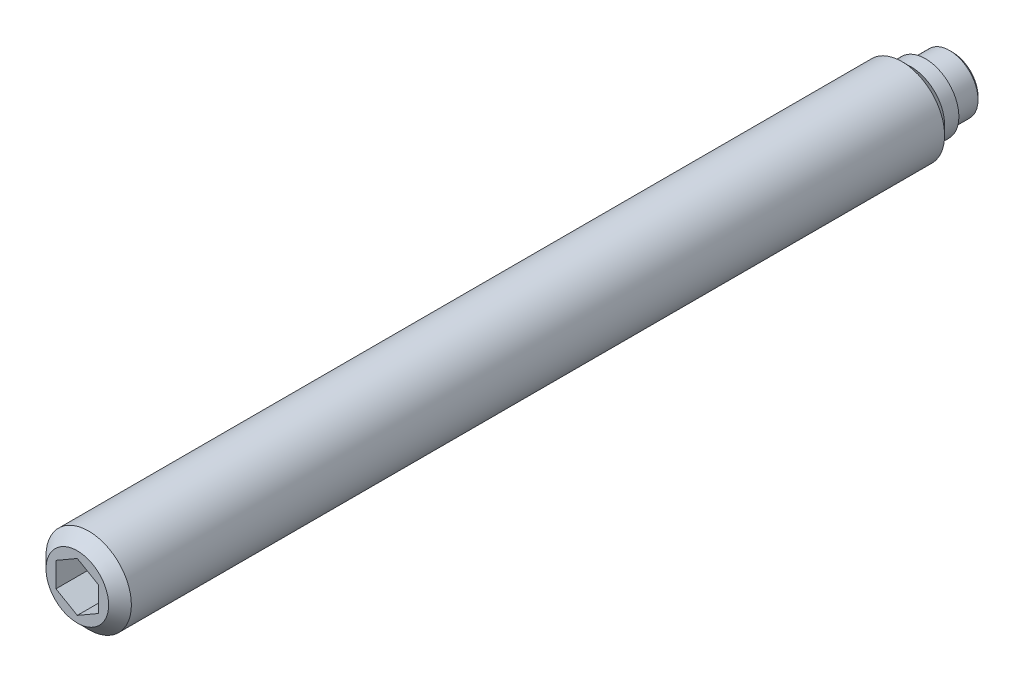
ISO-10303-21;
HEADER;
FILE_DESCRIPTION(('STEP AP214'),'2;1');
FILE_NAME('part.step','',(''),(''),'','','');
FILE_SCHEMA(('AUTOMOTIVE_DESIGN { 1 0 10303 214 1 1 1 1 }'));
ENDSEC;
DATA;
#1=APPLICATION_CONTEXT('core data for automotive mechanical design processes');
#2=APPLICATION_PROTOCOL_DEFINITION('international standard','automotive_design',2000,#1);
#3=PRODUCT_CONTEXT('',#1,'mechanical');
#4=PRODUCT('Part','Part','',(#3));
#5=PRODUCT_RELATED_PRODUCT_CATEGORY('part','',(#4));
#6=PRODUCT_DEFINITION_FORMATION('','',#4);
#7=PRODUCT_DEFINITION_CONTEXT('part definition',#1,'design');
#8=PRODUCT_DEFINITION('design','',#6,#7);
#9=PRODUCT_DEFINITION_SHAPE('','',#8);
#10=(LENGTH_UNIT() NAMED_UNIT(*) SI_UNIT(.MILLI.,.METRE.));
#11=(NAMED_UNIT(*) PLANE_ANGLE_UNIT() SI_UNIT($,.RADIAN.));
#12=(NAMED_UNIT(*) SI_UNIT($,.STERADIAN.) SOLID_ANGLE_UNIT());
#13=UNCERTAINTY_MEASURE_WITH_UNIT(LENGTH_MEASURE(1.E-05),#10,'distance_accuracy_value','');
#14=(GEOMETRIC_REPRESENTATION_CONTEXT(3) GLOBAL_UNCERTAINTY_ASSIGNED_CONTEXT((#13)) GLOBAL_UNIT_ASSIGNED_CONTEXT((#10,
#11,#12)) REPRESENTATION_CONTEXT('',''));
#15=CARTESIAN_POINT('',(0.,0.,0.));
#16=DIRECTION('',(0.,0.,1.));
#17=DIRECTION('',(1.,0.,0.));
#18=AXIS2_PLACEMENT_3D('',#15,#16,#17);
#19=CARTESIAN_POINT('',(0.,0.,1.9));
#20=DIRECTION('',(0.,0.,-1.));
#21=DIRECTION('',(-1.,0.,0.));
#22=AXIS2_PLACEMENT_3D('',#19,#20,#21);
#23=CYLINDRICAL_SURFACE('',#22,3.);
#24=CARTESIAN_POINT('',(0.,0.,3.55));
#25=DIRECTION('',(0.,0.,-1.));
#26=DIRECTION('',(-1.,0.,0.));
#27=AXIS2_PLACEMENT_3D('',#24,#25,#26);
#28=CIRCLE('',#27,3.);
#29=CARTESIAN_POINT('',(-3.,0.,3.55));
#30=VERTEX_POINT('',#29);
#31=EDGE_CURVE('E9',#30,#30,#28,.T.);
#32=ORIENTED_EDGE('',*,*,#31,.F.);
#33=EDGE_LOOP('',(#32));
#34=FACE_BOUND('',#33,.T.);
#35=CARTESIAN_POINT('',(0.,0.,60.7));
#36=DIRECTION('',(0.,0.,1.));
#37=DIRECTION('',(1.,0.,0.));
#38=AXIS2_PLACEMENT_3D('',#35,#36,#37);
#39=CIRCLE('',#38,3.);
#40=CARTESIAN_POINT('',(3.,0.,60.7));
#41=VERTEX_POINT('',#40);
#42=EDGE_CURVE('E123',#41,#41,#39,.T.);
#43=ORIENTED_EDGE('',*,*,#42,.F.);
#44=EDGE_LOOP('',(#43));
#45=FACE_BOUND('',#44,.T.);
#46=ADVANCED_FACE('F14',(#34,#45),#23,.T.);
#47=CARTESIAN_POINT('',(0.,0.,3.55));
#48=DIRECTION('',(0.,0.,1.));
#49=DIRECTION('',(1.,0.,0.));
#50=AXIS2_PLACEMENT_3D('',#47,#48,#49);
#51=CONICAL_SURFACE('',#50,3.,0.785398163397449);
#52=ORIENTED_EDGE('',*,*,#31,.T.);
#53=EDGE_LOOP('',(#52));
#54=FACE_BOUND('',#53,.T.);
#55=CARTESIAN_POINT('',(0.,0.,2.9));
#56=DIRECTION('',(0.,0.,-1.));
#57=DIRECTION('',(-1.,0.,0.));
#58=AXIS2_PLACEMENT_3D('',#55,#56,#57);
#59=CIRCLE('',#58,2.35);
#60=CARTESIAN_POINT('',(-2.35,0.,2.9));
#61=VERTEX_POINT('',#60);
#62=EDGE_CURVE('E21',#61,#61,#59,.T.);
#63=ORIENTED_EDGE('',*,*,#62,.F.);
#64=EDGE_LOOP('',(#63));
#65=FACE_BOUND('',#64,.T.);
#66=ADVANCED_FACE('F143',(#54,#65),#51,.T.);
#67=CARTESIAN_POINT('',(0.,0.,1.9));
#68=DIRECTION('',(0.,0.,-1.));
#69=DIRECTION('',(-1.,0.,0.));
#70=AXIS2_PLACEMENT_3D('',#67,#68,#69);
#71=CYLINDRICAL_SURFACE('',#70,2.35);
#72=ORIENTED_EDGE('',*,*,#62,.T.);
#73=EDGE_LOOP('',(#72));
#74=FACE_BOUND('',#73,.T.);
#75=CARTESIAN_POINT('',(0.,0.,1.9));
#76=DIRECTION('',(0.,0.,-1.));
#77=DIRECTION('',(-1.,0.,0.));
#78=AXIS2_PLACEMENT_3D('',#75,#76,#77);
#79=CIRCLE('',#78,2.35);
#80=CARTESIAN_POINT('',(-2.35,0.,1.9));
#81=VERTEX_POINT('',#80);
#82=EDGE_CURVE('E135',#81,#81,#79,.T.);
#83=ORIENTED_EDGE('',*,*,#82,.F.);
#84=EDGE_LOOP('',(#83));
#85=FACE_BOUND('',#84,.T.);
#86=ADVANCED_FACE('F140',(#74,#85),#71,.T.);
#87=CARTESIAN_POINT('',(0.,2.35,1.9));
#88=DIRECTION('',(0.,0.,1.));
#89=DIRECTION('',(1.,0.,0.));
#90=AXIS2_PLACEMENT_3D('',#87,#88,#89);
#91=PLANE('',#90);
#92=ORIENTED_EDGE('',*,*,#82,.T.);
#93=EDGE_LOOP('',(#92));
#94=FACE_BOUND('',#93,.T.);
#95=CARTESIAN_POINT('',(0.,0.,1.9));
#96=DIRECTION('',(0.,0.,-1.));
#97=DIRECTION('',(-1.,0.,0.));
#98=AXIS2_PLACEMENT_3D('',#95,#96,#97);
#99=CIRCLE('',#98,2.);
#100=CARTESIAN_POINT('',(-2.,0.,1.9));
#101=VERTEX_POINT('',#100);
#102=EDGE_CURVE('E132',#101,#101,#99,.T.);
#103=ORIENTED_EDGE('',*,*,#102,.F.);
#104=EDGE_LOOP('',(#103));
#105=FACE_BOUND('',#104,.T.);
#106=ADVANCED_FACE('F151',(#94,#105),#91,.F.);
#107=CARTESIAN_POINT('',(0.,0.,0.));
#108=DIRECTION('',(0.,0.,-1.));
#109=DIRECTION('',(-1.,0.,0.));
#110=AXIS2_PLACEMENT_3D('',#107,#108,#109);
#111=CYLINDRICAL_SURFACE('',#110,2.);
#112=CARTESIAN_POINT('',(0.,0.,0.2));
#113=DIRECTION('',(0.,0.,-1.));
#114=DIRECTION('',(-1.,0.,0.));
#115=AXIS2_PLACEMENT_3D('',#112,#113,#114);
#116=CIRCLE('',#115,2.);
#117=CARTESIAN_POINT('',(-2.,0.,0.2));
#118=VERTEX_POINT('',#117);
#119=EDGE_CURVE('E129',#118,#118,#116,.T.);
#120=ORIENTED_EDGE('',*,*,#119,.F.);
#121=EDGE_LOOP('',(#120));
#122=FACE_BOUND('',#121,.T.);
#123=ORIENTED_EDGE('',*,*,#102,.T.);
#124=EDGE_LOOP('',(#123));
#125=FACE_BOUND('',#124,.T.);
#126=ADVANCED_FACE('F157',(#122,#125),#111,.T.);
#127=CARTESIAN_POINT('',(0.,0.,0.2));
#128=DIRECTION('',(0.,0.,1.));
#129=DIRECTION('',(1.,0.,0.));
#130=AXIS2_PLACEMENT_3D('',#127,#128,#129);
#131=CONICAL_SURFACE('',#130,2.,0.785398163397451);
#132=CARTESIAN_POINT('',(0.,0.,0.));
#133=DIRECTION('',(0.,0.,-1.));
#134=DIRECTION('',(-1.,0.,0.));
#135=AXIS2_PLACEMENT_3D('',#132,#133,#134);
#136=CIRCLE('',#135,1.8);
#137=CARTESIAN_POINT('',(-1.8,0.,0.));
#138=VERTEX_POINT('',#137);
#139=EDGE_CURVE('E126',#138,#138,#136,.T.);
#140=ORIENTED_EDGE('',*,*,#139,.F.);
#141=EDGE_LOOP('',(#140));
#142=FACE_BOUND('',#141,.T.);
#143=ORIENTED_EDGE('',*,*,#119,.T.);
#144=EDGE_LOOP('',(#143));
#145=FACE_BOUND('',#144,.T.);
#146=ADVANCED_FACE('F161',(#142,#145),#131,.T.);
#147=CARTESIAN_POINT('',(0.,1.8,0.));
#148=DIRECTION('',(0.,0.,1.));
#149=DIRECTION('',(1.,0.,0.));
#150=AXIS2_PLACEMENT_3D('',#147,#148,#149);
#151=PLANE('',#150);
#152=ORIENTED_EDGE('',*,*,#139,.T.);
#153=EDGE_LOOP('',(#152));
#154=FACE_BOUND('',#153,.T.);
#155=ADVANCED_FACE('F165',(#154),#151,.F.);
#156=CARTESIAN_POINT('',(0.,0.,61.5));
#157=DIRECTION('',(0.,0.,-1.));
#158=DIRECTION('',(-1.,0.,0.));
#159=AXIS2_PLACEMENT_3D('',#156,#157,#158);
#160=CONICAL_SURFACE('',#159,2.2,0.785398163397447);
#161=ORIENTED_EDGE('',*,*,#42,.T.);
#162=EDGE_LOOP('',(#161));
#163=FACE_BOUND('',#162,.T.);
#164=CARTESIAN_POINT('',(0.,0.,61.5));
#165=DIRECTION('',(0.,0.,1.));
#166=DIRECTION('',(1.,0.,0.));
#167=AXIS2_PLACEMENT_3D('',#164,#165,#166);
#168=CIRCLE('',#167,2.2);
#169=CARTESIAN_POINT('',(2.2,0.,61.5));
#170=VERTEX_POINT('',#169);
#171=EDGE_CURVE('E115',#170,#170,#168,.T.);
#172=ORIENTED_EDGE('',*,*,#171,.F.);
#173=EDGE_LOOP('',(#172));
#174=FACE_BOUND('',#173,.T.);
#175=ADVANCED_FACE('F169',(#163,#174),#160,.T.);
#176=CARTESIAN_POINT('',(0.,0.,61.5));
#177=DIRECTION('',(0.,0.,1.));
#178=DIRECTION('',(1.,0.,0.));
#179=AXIS2_PLACEMENT_3D('',#176,#177,#178);
#180=PLANE('',#179);
#181=DIRECTION('',(0.866025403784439,-0.5,0.));
#182=VECTOR('',#181,1.);
#183=CARTESIAN_POINT('',(-1.5,-0.866025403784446,61.5));
#184=LINE('',#183,#182);
#185=CARTESIAN_POINT('',(-1.5,-0.866025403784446,61.5));
#186=VERTEX_POINT('',#185);
#187=CARTESIAN_POINT('',(0.,-1.73205080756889,61.5));
#188=VERTEX_POINT('',#187);
#189=EDGE_CURVE('E28',#186,#188,#184,.T.);
#190=ORIENTED_EDGE('',*,*,#189,.F.);
#191=DIRECTION('',(0.,-1.,0.));
#192=VECTOR('',#191,1.);
#193=CARTESIAN_POINT('',(-1.5,0.866025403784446,61.5));
#194=LINE('',#193,#192);
#195=CARTESIAN_POINT('',(-1.5,0.866025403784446,61.5));
#196=VERTEX_POINT('',#195);
#197=EDGE_CURVE('E111',#196,#186,#194,.T.);
#198=ORIENTED_EDGE('',*,*,#197,.F.);
#199=DIRECTION('',(-0.866025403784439,-0.5,0.));
#200=VECTOR('',#199,1.);
#201=CARTESIAN_POINT('',(0.,1.73205080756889,61.5));
#202=LINE('',#201,#200);
#203=CARTESIAN_POINT('',(0.,1.73205080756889,61.5));
#204=VERTEX_POINT('',#203);
#205=EDGE_CURVE('E109',#204,#196,#202,.T.);
#206=ORIENTED_EDGE('',*,*,#205,.F.);
#207=DIRECTION('',(-0.866025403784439,0.5,0.));
#208=VECTOR('',#207,1.);
#209=CARTESIAN_POINT('',(1.5,0.866025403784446,61.5));
#210=LINE('',#209,#208);
#211=CARTESIAN_POINT('',(1.5,0.866025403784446,61.5));
#212=VERTEX_POINT('',#211);
#213=EDGE_CURVE('E76',#212,#204,#210,.T.);
#214=ORIENTED_EDGE('',*,*,#213,.F.);
#215=DIRECTION('',(0.,1.,0.));
#216=VECTOR('',#215,1.);
#217=CARTESIAN_POINT('',(1.5,-0.866025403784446,61.5));
#218=LINE('',#217,#216);
#219=CARTESIAN_POINT('',(1.5,-0.866025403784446,61.5));
#220=VERTEX_POINT('',#219);
#221=EDGE_CURVE('E105',#220,#212,#218,.T.);
#222=ORIENTED_EDGE('',*,*,#221,.F.);
#223=DIRECTION('',(0.866025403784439,0.5,0.));
#224=VECTOR('',#223,1.);
#225=CARTESIAN_POINT('',(0.,-1.73205080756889,61.5));
#226=LINE('',#225,#224);
#227=EDGE_CURVE('E102',#188,#220,#226,.T.);
#228=ORIENTED_EDGE('',*,*,#227,.F.);
#229=EDGE_LOOP('',(#190,#198,#206,#214,#222,#228));
#230=FACE_BOUND('',#229,.T.);
#231=ORIENTED_EDGE('',*,*,#171,.T.);
#232=EDGE_LOOP('',(#231));
#233=FACE_BOUND('',#232,.T.);
#234=ADVANCED_FACE('F173',(#230,#233),#180,.T.);
#235=CARTESIAN_POINT('',(-1.5,-0.866025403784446,58.));
#236=DIRECTION('',(-0.5,-0.866025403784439,0.));
#237=DIRECTION('',(0.866025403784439,-0.5,0.));
#238=AXIS2_PLACEMENT_3D('',#235,#236,#237);
#239=PLANE('',#238);
#240=ORIENTED_EDGE('',*,*,#189,.T.);
#241=DIRECTION('',(0.,0.,1.));
#242=VECTOR('',#241,1.);
#243=CARTESIAN_POINT('',(0.,-1.73205080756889,58.));
#244=LINE('',#243,#242);
#245=CARTESIAN_POINT('',(0.,-1.73205080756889,58.));
#246=VERTEX_POINT('',#245);
#247=EDGE_CURVE('E58',#246,#188,#244,.T.);
#248=ORIENTED_EDGE('',*,*,#247,.F.);
#249=DIRECTION('',(0.866025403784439,-0.5,0.));
#250=VECTOR('',#249,1.);
#251=CARTESIAN_POINT('',(-1.5,-0.866025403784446,58.));
#252=LINE('',#251,#250);
#253=CARTESIAN_POINT('',(-1.5,-0.866025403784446,58.));
#254=VERTEX_POINT('',#253);
#255=EDGE_CURVE('E113',#254,#246,#252,.T.);
#256=ORIENTED_EDGE('',*,*,#255,.F.);
#257=DIRECTION('',(0.,0.,1.));
#258=VECTOR('',#257,1.);
#259=CARTESIAN_POINT('',(-1.5,-0.866025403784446,58.));
#260=LINE('',#259,#258);
#261=EDGE_CURVE('E36',#254,#186,#260,.T.);
#262=ORIENTED_EDGE('',*,*,#261,.T.);
#263=EDGE_LOOP('',(#240,#248,#256,#262));
#264=FACE_BOUND('',#263,.T.);
#265=ADVANCED_FACE('F177',(#264),#239,.F.);
#266=CARTESIAN_POINT('',(-1.5,0.866025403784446,58.));
#267=DIRECTION('',(-1.,0.,0.));
#268=DIRECTION('',(0.,0.,1.));
#269=AXIS2_PLACEMENT_3D('',#266,#267,#268);
#270=PLANE('',#269);
#271=ORIENTED_EDGE('',*,*,#197,.T.);
#272=ORIENTED_EDGE('',*,*,#261,.F.);
#273=DIRECTION('',(0.,-1.,0.));
#274=VECTOR('',#273,1.);
#275=CARTESIAN_POINT('',(-1.5,0.866025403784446,58.));
#276=LINE('',#275,#274);
#277=CARTESIAN_POINT('',(-1.5,0.866025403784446,58.));
#278=VERTEX_POINT('',#277);
#279=EDGE_CURVE('E88',#278,#254,#276,.T.);
#280=ORIENTED_EDGE('',*,*,#279,.F.);
#281=DIRECTION('',(0.,0.,1.));
#282=VECTOR('',#281,1.);
#283=CARTESIAN_POINT('',(-1.5,0.866025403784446,58.));
#284=LINE('',#283,#282);
#285=EDGE_CURVE('E80',#278,#196,#284,.T.);
#286=ORIENTED_EDGE('',*,*,#285,.T.);
#287=EDGE_LOOP('',(#271,#272,#280,#286));
#288=FACE_BOUND('',#287,.T.);
#289=ADVANCED_FACE('F181',(#288),#270,.F.);
#290=CARTESIAN_POINT('',(0.,1.73205080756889,58.));
#291=DIRECTION('',(-0.5,0.866025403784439,0.));
#292=DIRECTION('',(-0.866025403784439,-0.5,0.));
#293=AXIS2_PLACEMENT_3D('',#290,#291,#292);
#294=PLANE('',#293);
#295=ORIENTED_EDGE('',*,*,#205,.T.);
#296=ORIENTED_EDGE('',*,*,#285,.F.);
#297=DIRECTION('',(-0.866025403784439,-0.5,0.));
#298=VECTOR('',#297,1.);
#299=CARTESIAN_POINT('',(0.,1.73205080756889,58.));
#300=LINE('',#299,#298);
#301=CARTESIAN_POINT('',(0.,1.73205080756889,58.));
#302=VERTEX_POINT('',#301);
#303=EDGE_CURVE('E84',#302,#278,#300,.T.);
#304=ORIENTED_EDGE('',*,*,#303,.F.);
#305=DIRECTION('',(0.,0.,1.));
#306=VECTOR('',#305,1.);
#307=CARTESIAN_POINT('',(0.,1.73205080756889,58.));
#308=LINE('',#307,#306);
#309=EDGE_CURVE('E69',#302,#204,#308,.T.);
#310=ORIENTED_EDGE('',*,*,#309,.T.);
#311=EDGE_LOOP('',(#295,#296,#304,#310));
#312=FACE_BOUND('',#311,.T.);
#313=ADVANCED_FACE('F85',(#312),#294,.F.);
#314=CARTESIAN_POINT('',(1.5,0.866025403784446,58.));
#315=DIRECTION('',(0.5,0.866025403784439,0.));
#316=DIRECTION('',(-0.866025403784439,0.5,0.));
#317=AXIS2_PLACEMENT_3D('',#314,#315,#316);
#318=PLANE('',#317);
#319=ORIENTED_EDGE('',*,*,#213,.T.);
#320=ORIENTED_EDGE('',*,*,#309,.F.);
#321=DIRECTION('',(-0.866025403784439,0.5,0.));
#322=VECTOR('',#321,1.);
#323=CARTESIAN_POINT('',(1.5,0.866025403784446,58.));
#324=LINE('',#323,#322);
#325=CARTESIAN_POINT('',(1.5,0.866025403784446,58.));
#326=VERTEX_POINT('',#325);
#327=EDGE_CURVE('E73',#326,#302,#324,.T.);
#328=ORIENTED_EDGE('',*,*,#327,.F.);
#329=DIRECTION('',(0.,0.,1.));
#330=VECTOR('',#329,1.);
#331=CARTESIAN_POINT('',(1.5,0.866025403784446,58.));
#332=LINE('',#331,#330);
#333=EDGE_CURVE('E81',#326,#212,#332,.T.);
#334=ORIENTED_EDGE('',*,*,#333,.T.);
#335=EDGE_LOOP('',(#319,#320,#328,#334));
#336=FACE_BOUND('',#335,.T.);
#337=ADVANCED_FACE('F71',(#336),#318,.F.);
#338=CARTESIAN_POINT('',(1.5,-0.866025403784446,58.));
#339=DIRECTION('',(1.,0.,0.));
#340=DIRECTION('',(0.,0.,-1.));
#341=AXIS2_PLACEMENT_3D('',#338,#339,#340);
#342=PLANE('',#341);
#343=ORIENTED_EDGE('',*,*,#221,.T.);
#344=ORIENTED_EDGE('',*,*,#333,.F.);
#345=DIRECTION('',(0.,1.,0.));
#346=VECTOR('',#345,1.);
#347=CARTESIAN_POINT('',(1.5,-0.866025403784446,58.));
#348=LINE('',#347,#346);
#349=CARTESIAN_POINT('',(1.5,-0.866025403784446,58.));
#350=VERTEX_POINT('',#349);
#351=EDGE_CURVE('E94',#350,#326,#348,.T.);
#352=ORIENTED_EDGE('',*,*,#351,.F.);
#353=DIRECTION('',(0.,0.,1.));
#354=VECTOR('',#353,1.);
#355=CARTESIAN_POINT('',(1.5,-0.866025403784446,58.));
#356=LINE('',#355,#354);
#357=EDGE_CURVE('E118',#350,#220,#356,.T.);
#358=ORIENTED_EDGE('',*,*,#357,.T.);
#359=EDGE_LOOP('',(#343,#344,#352,#358));
#360=FACE_BOUND('',#359,.T.);
#361=ADVANCED_FACE('F185',(#360),#342,.F.);
#362=CARTESIAN_POINT('',(0.,-1.73205080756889,58.));
#363=DIRECTION('',(0.5,-0.866025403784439,0.));
#364=DIRECTION('',(0.866025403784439,0.5,0.));
#365=AXIS2_PLACEMENT_3D('',#362,#363,#364);
#366=PLANE('',#365);
#367=ORIENTED_EDGE('',*,*,#227,.T.);
#368=ORIENTED_EDGE('',*,*,#357,.F.);
#369=DIRECTION('',(0.866025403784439,0.5,0.));
#370=VECTOR('',#369,1.);
#371=CARTESIAN_POINT('',(0.,-1.73205080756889,58.));
#372=LINE('',#371,#370);
#373=EDGE_CURVE('E96',#246,#350,#372,.T.);
#374=ORIENTED_EDGE('',*,*,#373,.F.);
#375=ORIENTED_EDGE('',*,*,#247,.T.);
#376=EDGE_LOOP('',(#367,#368,#374,#375));
#377=FACE_BOUND('',#376,.T.);
#378=ADVANCED_FACE('F182',(#377),#366,.F.);
#379=CARTESIAN_POINT('',(0.,0.,58.));
#380=DIRECTION('',(0.,0.,1.));
#381=DIRECTION('',(1.,0.,0.));
#382=AXIS2_PLACEMENT_3D('',#379,#380,#381);
#383=PLANE('',#382);
#384=ORIENTED_EDGE('',*,*,#255,.T.);
#385=ORIENTED_EDGE('',*,*,#373,.T.);
#386=ORIENTED_EDGE('',*,*,#351,.T.);
#387=ORIENTED_EDGE('',*,*,#327,.T.);
#388=ORIENTED_EDGE('',*,*,#303,.T.);
#389=ORIENTED_EDGE('',*,*,#279,.T.);
#390=EDGE_LOOP('',(#384,#385,#386,#387,#388,#389));
#391=FACE_BOUND('',#390,.T.);
#392=ADVANCED_FACE('F91',(#391),#383,.T.);
#393=CLOSED_SHELL('',(#46,#66,#86,#106,#126,#146,#155,#175,#234,#265,#289,#313,#337,#361,#378,#392));
#394=MANIFOLD_SOLID_BREP('B1',#393);
#395=ADVANCED_BREP_SHAPE_REPRESENTATION('',(#18,#394),#14);
#396=SHAPE_DEFINITION_REPRESENTATION(#9,#395);
ENDSEC;
END-ISO-10303-21;
